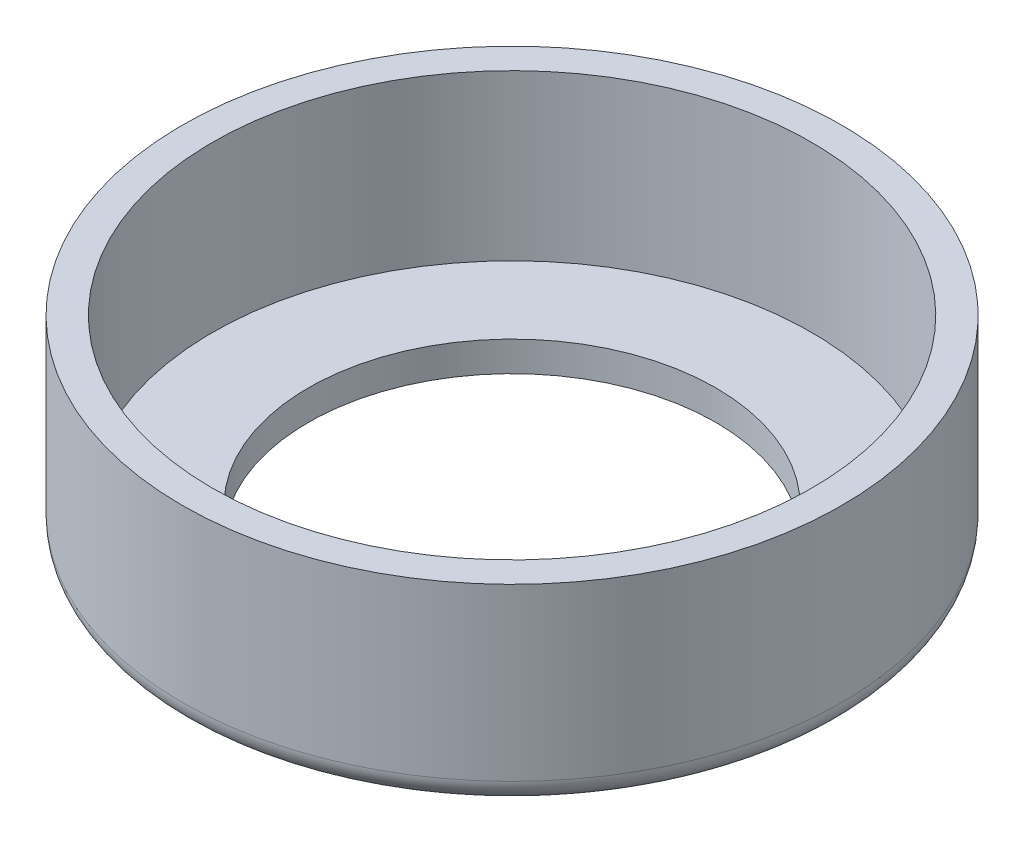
from build123d import *

# Parameters (mm, degrees)
SKETCH1_R          = 17.4625
EXTRUDE1_DEPTH     = 10.3124
FILLET1_R          = 1.27
SHELL1_T           = -1.5875
SKETCH2_R          = 10.795
CUT_EXTRUDE1_DEPTH = 27.762350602


with BuildPart() as part:
    # Sketch1 → Extrude1 (new body)
    with BuildSketch(Plane(origin=(0, 0, 0), x_dir=(1, 0, 0), z_dir=(0, 1, 0))):
        with Locations(Location((0, 0, 0), (0, 0, 270))):
            Circle(SKETCH1_R)
    extrude(amount=EXTRUDE1_DEPTH)

    # Fillet1
    fillet1_edges = [part.edges().sort_by_distance(p)[0] for p in [
        (0, 0, -17.4625),
    ]]
    fillet(fillet1_edges, radius=FILLET1_R)

    # Shell1
    shell1_openings = [part.faces().sort_by_distance(p)[0] for p in [
        (0, 10.3124, 0),
    ]]
    offset(amount=SHELL1_T, openings=shell1_openings, kind=Kind.INTERSECTION)

    # Sketch2 → Cut-Extrude1 (cut, through all)
    with BuildSketch(Plane.XZ):
        with Locations(Location((0, 0, 0), (0, 0, 270))):
            Circle(SKETCH2_R)
    extrude(amount=-CUT_EXTRUDE1_DEPTH, mode=Mode.SUBTRACT)


solid = part.part
